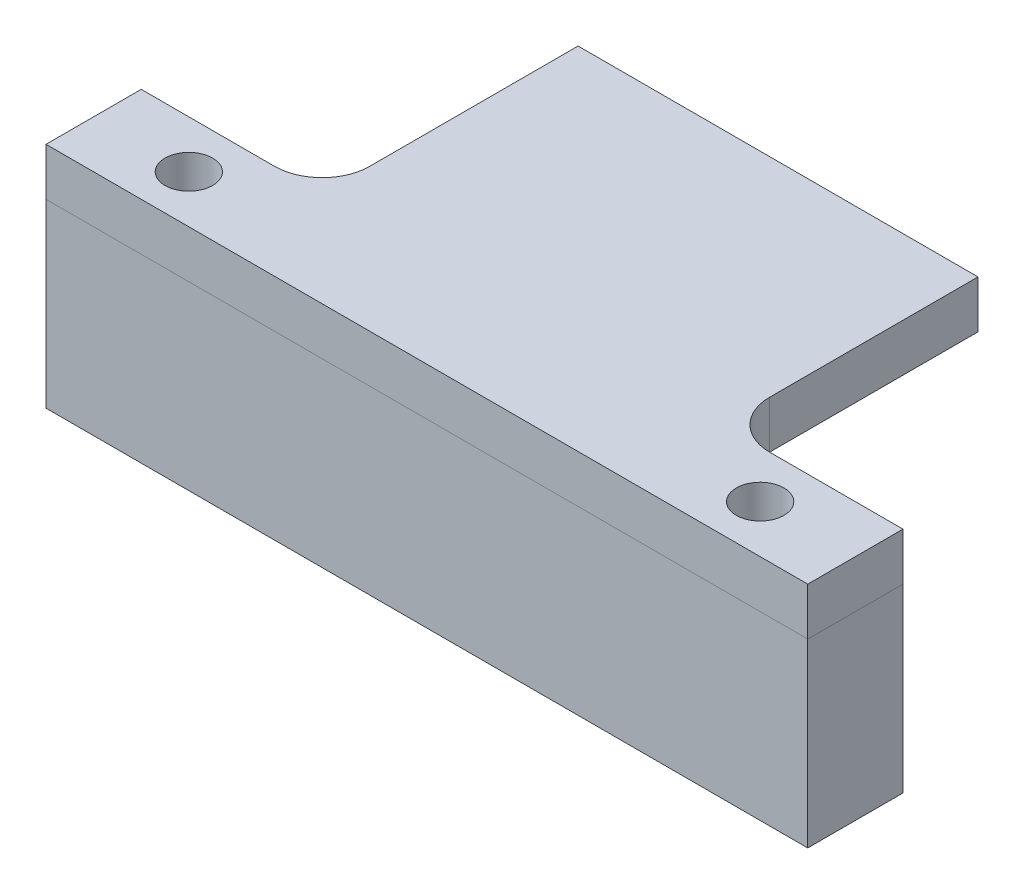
from build123d import *

# Parameters (mm, degrees)
SKETCH1_W           = 50.8
SKETCH1_H           = 6.35
SKETCH1_R           = 1.5875
BOSS_EXTRUDE1_DEPTH = 12.065
BOSS_EXTRUDE2_START = 12.065
SKETCH1_2_W         = 50.8
SKETCH1_2_H         = 6.35
SKETCH1_2_R         = 1.5875
BOSS_EXTRUDE2_DEPTH = 3.175
SKETCH2_W           = 26.67
SKETCH2_H           = 17.0688
BOSS_EXTRUDE3_DEPTH = 3.175
FILLET1_R           = 3.175


with BuildPart() as part:
    # Sketch1 → Boss-Extrude1 (new body)
    with BuildSketch(Plane(origin=(0, 0, 0), x_dir=(1, 0, 0), z_dir=(0, 1, 0))):
        Rectangle(SKETCH1_W, SKETCH1_H)
        with Locations(Location((-19.05, 0, 0), (0, 0, 90))):
            Circle(SKETCH1_R, mode=Mode.SUBTRACT)
        with Locations(Location((19.05, 0, 0), (0, 0, 90))):
            Circle(SKETCH1_R, mode=Mode.SUBTRACT)
    extrude(amount=BOSS_EXTRUDE1_DEPTH)


with BuildPart() as body_2:
    # Sketch1_2 → Boss-Extrude2 (new body)
    with BuildSketch(Plane(origin=(0, 0, 0), x_dir=(1, 0, 0), z_dir=(0, 1, 0)).offset(BOSS_EXTRUDE2_START)):
        Rectangle(SKETCH1_2_W, SKETCH1_2_H)
        with Locations(Location((-19.05, 0, 0), (0, 0, 90))):
            Circle(SKETCH1_2_R, mode=Mode.SUBTRACT)
        with Locations(Location((19.05, 0, 0), (0, 0, 90))):
            Circle(SKETCH1_2_R, mode=Mode.SUBTRACT)
    extrude(amount=BOSS_EXTRUDE2_DEPTH)

    # Sketch2 → Boss-Extrude3 (add)
    with BuildSketch(Plane(origin=(0, 15.24, 0), x_dir=(1, 0, 0), z_dir=(0, 1, 0))):
        with Locations((0, 11.7094)):
            Rectangle(SKETCH2_W, SKETCH2_H)
    extrude(amount=-BOSS_EXTRUDE3_DEPTH)

    # Fillet1
    fillet1_edges = [body_2.edges().sort_by_distance(p)[0] for p in [
        (13.335, 13.6525, -3.175),
        (-13.335, 13.6525, -3.175),
    ]]
    fillet(fillet1_edges, radius=FILLET1_R)


solid = Compound([part.part, body_2.part])
